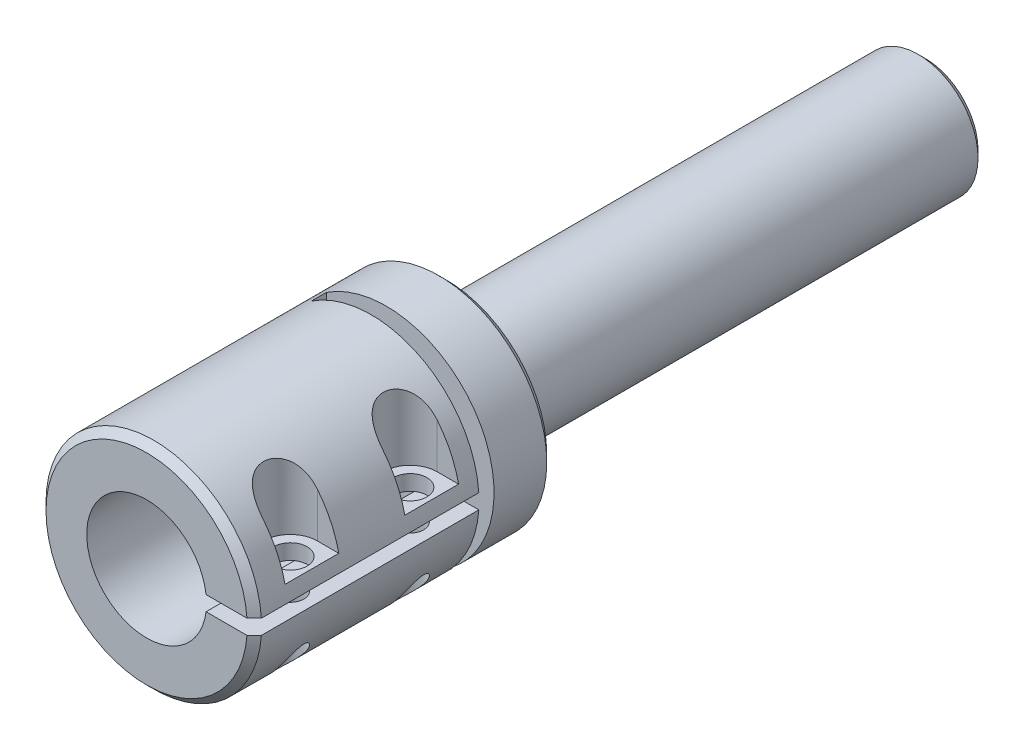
from build123d import *

# Parameters (mm, degrees)
SKETCH1_R                 = 11.43
BOSS_EXTRUDE1_DEPTH       = 31.75
SKETCH2_R                 = 6.35
CUT_EXTRUDE1_DEPTH        = 25.4
SKETCH3_R                 = 6.35
BOSS_EXTRUDE2_DEPTH       = 50.8
CHAMFER1_SIZE             = 0.762
SKETCH4_R                 = 1.778
CUT_EXTRUDE2_DEPTH        = 3.175
CUT_EXTRUDE3_REACH        = 86.118
SKETCH5_W                 = 31.085363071
SKETCH5_H                 = 1.5748
CUT_EXTRUDE4_DEPTH        = 54.878692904
SKETCH7_W                 = 1.5875
SKETCH7_H                 = 51.373250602
CUT_EXTRUDE5_DEPTH        = 56.02193477
SKETCH8_R                 = 6.35
SKETCH8_R_2               = 6.0325
CUT_EXTRUDE6_DEPTH        = 0.381
CHAMFER2_SIZE             = 0.762
F_6_40_TAPPED_HOLE1_D     = 2.8702
F_6_40_TAPPED_HOLE1_DEPTH = 10.414
F_6_40_TAPPED_HOLE1_TIP   = 0.862295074


with BuildPart() as part:
    # Sketch1 → Boss-Extrude1 (new body)
    with BuildSketch(Plane.XY):
        Circle(SKETCH1_R)
    extrude(amount=BOSS_EXTRUDE1_DEPTH)

    # Sketch2 → Cut-Extrude1 (cut)
    with BuildSketch(Plane.XY.offset(31.75)):
        Circle(SKETCH2_R)
    extrude(amount=-CUT_EXTRUDE1_DEPTH, mode=Mode.SUBTRACT)

    # Sketch3 → Boss-Extrude2 (add)
    with BuildSketch(Plane(origin=(0, 0, 0), x_dir=(-1, 0, 0), z_dir=(0, 0, -1))):
        with Locations(Location((0, 0, 0), (0, 0, 180))):
            Circle(SKETCH3_R)
    extrude(amount=BOSS_EXTRUDE2_DEPTH)

    # Chamfer1
    chamfer1_edges = [part.edges().sort_by_distance(p)[0] for p in [
        (-6.35, 0, -50.8),
    ]]
    chamfer(chamfer1_edges, length=CHAMFER1_SIZE)

    # Sketch4 → Cut-Extrude2 (cut)
    with BuildSketch(Plane(origin=(0, 2.413, 0), x_dir=(-1, 0, 0), z_dir=(0, 1, 0))):
        with Locations(Location((-8.89, 25.4, 0), (0, 0, 90))):
            Circle(SKETCH4_R)
        with Locations(Location((-8.89, 12.7, 0), (0, 0, 90))):
            Circle(SKETCH4_R)
    extrude(amount=-CUT_EXTRUDE2_DEPTH, mode=Mode.SUBTRACT)

    # Cut-Extrude3: up to this face of the body (flat: up to its plane)
    cut_extrude3_end = Plane(part.part.faces().sort_by_distance((0, 0, 6.35))[0])
    # Sketch5 → Cut-Extrude3 (cut, up to the picked face)
    with BuildSketch(Plane.XY.offset(31.75), mode=Mode.PRIVATE) as cut_extrude3_sk1:
        with Locations((15.542681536, 0)):
            Rectangle(SKETCH5_W, SKETCH5_H)
    cut_extrude3_tool1 = split(extrude(cut_extrude3_sk1.sketch, amount=-CUT_EXTRUDE3_REACH, mode=Mode.PRIVATE), bisect_by=cut_extrude3_end, keep=Keep.BOTH, mode=Mode.PRIVATE)
    add(cut_extrude3_tool1.solids().sort_by(Axis((15.542682, 0, 31.75), (0, 0, -1)))[0], mode=Mode.SUBTRACT)

    # Sketch6 → Cut-Extrude4 (cut, through all)
    with BuildSketch(Plane(origin=(0, 2.413, 0), x_dir=(-1, 0, 0), z_dir=(0, 1, 0))):
        with BuildLine():
            Line((-8.89, 28.25), (-11.40284619, 28.25))
            Line((-11.40284619, 28.25), (-11.40284619, 22.55))
            Line((-11.40284619, 22.55), (-8.89, 22.55))
            ThreePointArc((-8.89, 22.55), (-6.04, 25.4), (-8.89, 28.25))
        make_face()
        with BuildLine():
            Line((-8.89, 15.55), (-11.40284619, 15.55))
            Line((-11.40284619, 15.55), (-11.40284619, 9.85))
            Line((-11.40284619, 9.85), (-8.89, 9.85))
            ThreePointArc((-8.89, 9.85), (-6.04, 12.7), (-8.89, 15.55))
        make_face()
    extrude(amount=CUT_EXTRUDE4_DEPTH, mode=Mode.SUBTRACT)

    # Sketch7 → Cut-Extrude5 (cut, through all)
    with BuildSketch(Plane(origin=(-6.35, 0, 0), x_dir=(0, 0, -1), z_dir=(1, 0, 0))):
        with Locations((-7.14375, 0.912235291)):
            Rectangle(SKETCH7_W, SKETCH7_H)
    extrude(amount=CUT_EXTRUDE5_DEPTH, mode=Mode.SUBTRACT)

    # Sketch8 → Cut-Extrude6 (cut)
    with BuildSketch(Plane(origin=(0, 0, 0), x_dir=(-1, 0, 0), z_dir=(0, 0, -1))):
        with Locations(Location((0, 0, 0), (0, 0, 180))):
            Circle(SKETCH8_R)
        with Locations(Location((0, 0, 0), (0, 0, 180))):
            Circle(SKETCH8_R_2, mode=Mode.SUBTRACT)
    extrude(amount=CUT_EXTRUDE6_DEPTH, mode=Mode.SUBTRACT)

    # Chamfer2
    chamfer2_edges = [part.edges().sort_by_distance(p)[0] for p in [
        (-11.43, 0, 0),
        (-11.43, 0, 31.75),
    ]]
    chamfer(chamfer2_edges, length=CHAMFER2_SIZE)

    # 6-40 Tapped Hole1
    with Locations(Plane(origin=(0, -0.7874, 0), x_dir=(1, 0, 0), z_dir=(0, 1, 0))):
        with Locations((8.89, -12.7), (8.89, -25.4)):
            Hole(F_6_40_TAPPED_HOLE1_D / 2, depth=F_6_40_TAPPED_HOLE1_DEPTH)
            with Locations((0, 0, -(F_6_40_TAPPED_HOLE1_DEPTH + F_6_40_TAPPED_HOLE1_TIP / 2))):  # 118° drill point
                Cone(0, F_6_40_TAPPED_HOLE1_D / 2, F_6_40_TAPPED_HOLE1_TIP, mode=Mode.SUBTRACT)


solid = part.part
